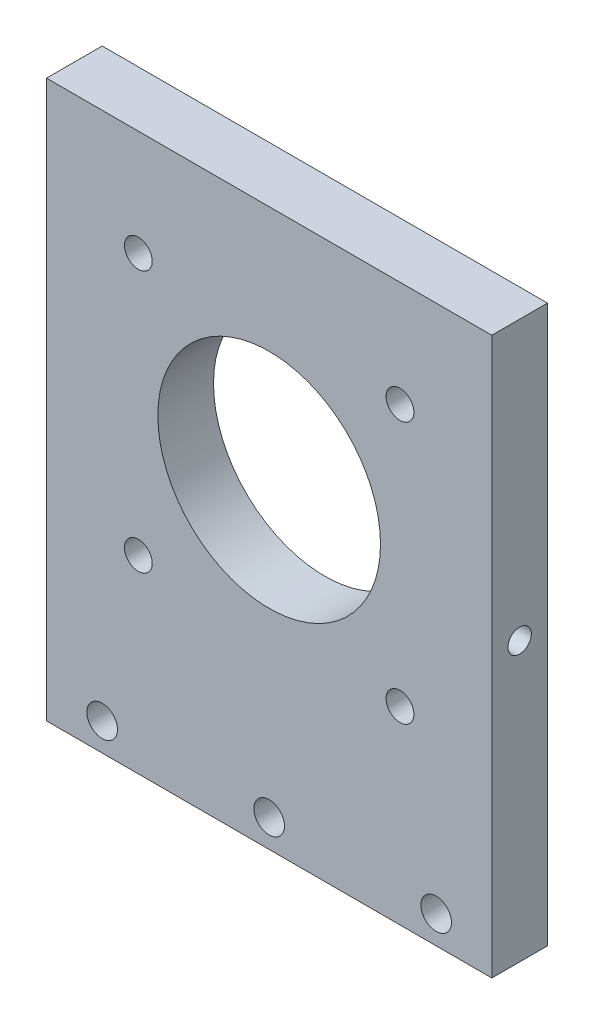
from build123d import *

# Parameters (mm, degrees)
SKETCH_2_W              = 80
SKETCH_2_H              = 100
EXTRUDE_1_DEPTH         = 10
HOLE_WIZARD_M51_D       = 5.5
SKETCH_7_R              = 20
SKETCH_7_R_2            = 2.5
CUT_EXTRUDE_1_DEPTH     = 10
HOLE_WIZARD_M51_2_D     = 4.2
HOLE_WIZARD_M51_2_DEPTH = 10
HOLE_WIZARD_M51_2_TIP   = 1.2618073
HOLE_WIZARD_M52_D       = 4.2
HOLE_WIZARD_M52_DEPTH   = 10
HOLE_WIZARD_M52_TIP     = 1.2618073


with BuildPart() as part:
    # Sketch 2 → Extrude 1 (new body)
    with BuildSketch(Plane.XY):
        Rectangle(SKETCH_2_W, SKETCH_2_H)
    extrude(amount=EXTRUDE_1_DEPTH)

    # Hole Wizard M51 (through all)
    with Locations(Plane(origin=(0, 0, 0), x_dir=(-1, 0, 0), z_dir=(0, 0, -1))):
        with Locations((-30, -45), (0, -45), (30, -45)):
            Hole(HOLE_WIZARD_M51_D / 2)

    # Sketch 7 → Cut-Extrude 1 (cut)
    with BuildSketch(Plane(origin=(0, 0, 0), x_dir=(-1, 0, 0), z_dir=(0, 0, -1))):
        with Locations((0, 7.5)):
            Circle(SKETCH_7_R)
        with Locations((-23.5, 31)):
            Circle(SKETCH_7_R_2)
        with Locations((23.5, 31)):
            Circle(SKETCH_7_R_2)
        with Locations((23.5, -16)):
            Circle(SKETCH_7_R_2)
        with Locations((-23.5, -16)):
            Circle(SKETCH_7_R_2)
    extrude(amount=-CUT_EXTRUDE_1_DEPTH, mode=Mode.SUBTRACT)

    # Hole Wizard M51 2
    with Locations(Plane(origin=(40, 0, 0), x_dir=(0, 0, -1), z_dir=(1, 0, 0))):
        with Locations((-5, 0)):
            Hole(HOLE_WIZARD_M51_2_D / 2, depth=HOLE_WIZARD_M51_2_DEPTH)
            with Locations((0, 0, -(HOLE_WIZARD_M51_2_DEPTH + HOLE_WIZARD_M51_2_TIP / 2))):  # 118° drill point
                Cone(0, HOLE_WIZARD_M51_2_D / 2, HOLE_WIZARD_M51_2_TIP, mode=Mode.SUBTRACT)

    # Hole Wizard M52
    with Locations(Plane.ZY.offset(40)):
        with Locations((5, 0)):
            Hole(HOLE_WIZARD_M52_D / 2, depth=HOLE_WIZARD_M52_DEPTH)
            with Locations((0, 0, -(HOLE_WIZARD_M52_DEPTH + HOLE_WIZARD_M52_TIP / 2))):  # 118° drill point
                Cone(0, HOLE_WIZARD_M52_D / 2, HOLE_WIZARD_M52_TIP, mode=Mode.SUBTRACT)


solid = part.part
